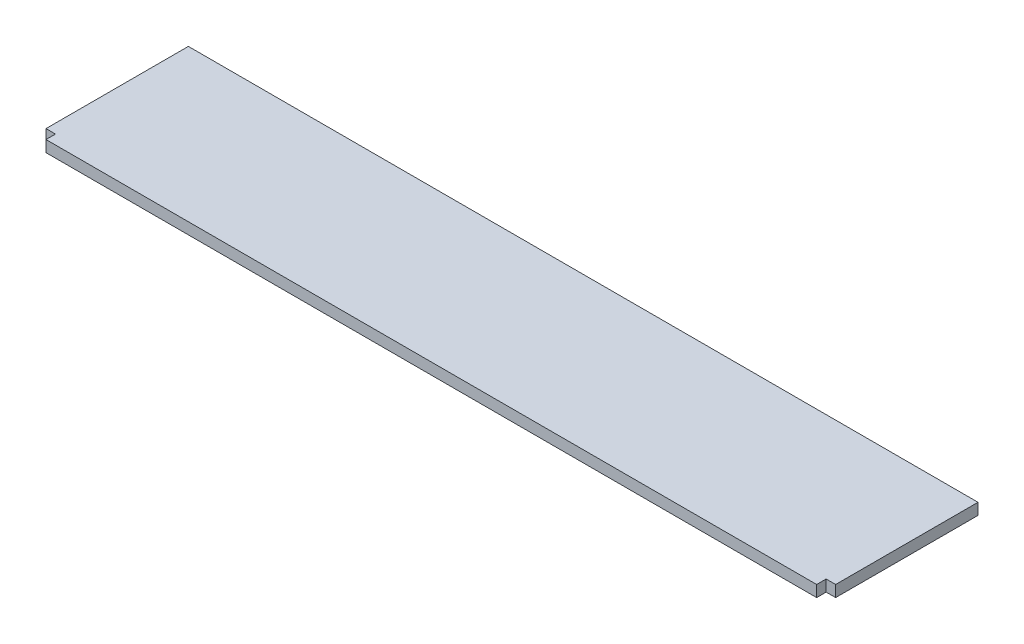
from build123d import *

# Parameters (mm, degrees)
ESQUISSE1_W             = 2080
ESQUISSE1_H             = 400
BOSS_EXTRU_1_DEPTH      = 30
ESQUISSE2_W             = 25
ESQUISSE2_H             = 25
ENL_V_MAT_EXTRU_1_DEPTH = 2119.324809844


with BuildPart() as part:
    # Esquisse1 → Boss.-Extru.1 (new body)
    with BuildSketch(Plane(origin=(0, 0, 0), x_dir=(1, 0, 0), z_dir=(0, 1, 0))):
        with Locations((1040, 200)):
            Rectangle(ESQUISSE1_W, ESQUISSE1_H)
    extrude(amount=BOSS_EXTRU_1_DEPTH)

    # Esquisse2 → Enl_v. mat.-Extru.1 (cut, through all)
    with BuildSketch(Plane(origin=(0, 30, 0), x_dir=(1, 0, 0), z_dir=(0, 1, 0))):
        with Locations((2067.5, 12.5)):
            Rectangle(ESQUISSE2_W, ESQUISSE2_H)
        with Locations((12.5, 12.5)):
            Rectangle(ESQUISSE2_W, ESQUISSE2_H)
    extrude(amount=-ENL_V_MAT_EXTRU_1_DEPTH, mode=Mode.SUBTRACT)


solid = part.part
